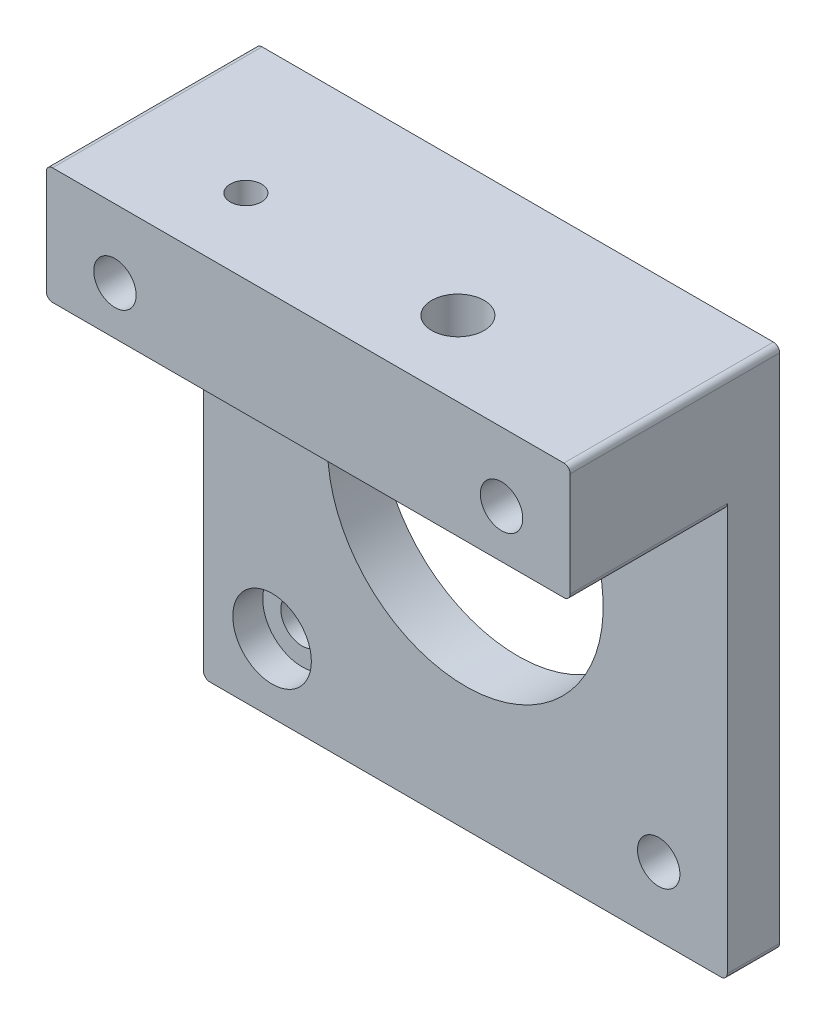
ISO-10303-21;
HEADER;
FILE_DESCRIPTION(('STEP AP214'),'2;1');
FILE_NAME('part.step','',(''),(''),'','','');
FILE_SCHEMA(('AUTOMOTIVE_DESIGN { 1 0 10303 214 1 1 1 1 }'));
ENDSEC;
DATA;
#1=APPLICATION_CONTEXT('core data for automotive mechanical design processes');
#2=APPLICATION_PROTOCOL_DEFINITION('international standard','automotive_design',2000,#1);
#3=PRODUCT_CONTEXT('',#1,'mechanical');
#4=PRODUCT('Part','Part','',(#3));
#5=PRODUCT_RELATED_PRODUCT_CATEGORY('part','',(#4));
#6=PRODUCT_DEFINITION_FORMATION('','',#4);
#7=PRODUCT_DEFINITION_CONTEXT('part definition',#1,'design');
#8=PRODUCT_DEFINITION('design','',#6,#7);
#9=PRODUCT_DEFINITION_SHAPE('','',#8);
#10=(LENGTH_UNIT() NAMED_UNIT(*) SI_UNIT(.MILLI.,.METRE.));
#11=(NAMED_UNIT(*) PLANE_ANGLE_UNIT() SI_UNIT($,.RADIAN.));
#12=(NAMED_UNIT(*) SI_UNIT($,.STERADIAN.) SOLID_ANGLE_UNIT());
#13=UNCERTAINTY_MEASURE_WITH_UNIT(LENGTH_MEASURE(1.E-05),#10,'distance_accuracy_value','');
#14=(GEOMETRIC_REPRESENTATION_CONTEXT(3) GLOBAL_UNCERTAINTY_ASSIGNED_CONTEXT((#13)) GLOBAL_UNIT_ASSIGNED_CONTEXT((#10,
#11,#12)) REPRESENTATION_CONTEXT('',''));
#15=CARTESIAN_POINT('',(0.,0.,0.));
#16=DIRECTION('',(0.,0.,1.));
#17=DIRECTION('',(1.,0.,0.));
#18=AXIS2_PLACEMENT_3D('',#15,#16,#17);
#19=CARTESIAN_POINT('',(-15.5,-15.5,1.8));
#20=DIRECTION('',(0.,0.,1.));
#21=DIRECTION('',(1.,0.,0.));
#22=AXIS2_PLACEMENT_3D('',#19,#20,#21);
#23=CYLINDRICAL_SURFACE('',#22,3.15);
#24=CARTESIAN_POINT('',(-15.5,-15.5,1.8));
#25=DIRECTION('',(0.,0.,1.));
#26=DIRECTION('',(1.,0.,0.));
#27=AXIS2_PLACEMENT_3D('',#24,#25,#26);
#28=CIRCLE('',#27,3.15);
#29=CARTESIAN_POINT('',(-12.35,-15.5,1.8));
#30=VERTEX_POINT('',#29);
#31=EDGE_CURVE('E20',#30,#30,#28,.T.);
#32=ORIENTED_EDGE('',*,*,#31,.F.);
#33=EDGE_LOOP('',(#32));
#34=FACE_BOUND('',#33,.T.);
#35=CARTESIAN_POINT('',(-15.5,-15.5,4.2));
#36=DIRECTION('',(0.,0.,1.));
#37=DIRECTION('',(1.,0.,0.));
#38=AXIS2_PLACEMENT_3D('',#35,#36,#37);
#39=CIRCLE('',#38,3.15);
#40=CARTESIAN_POINT('',(-12.35,-15.5,4.2));
#41=VERTEX_POINT('',#40);
#42=EDGE_CURVE('E218',#41,#41,#39,.T.);
#43=ORIENTED_EDGE('',*,*,#42,.T.);
#44=EDGE_LOOP('',(#43));
#45=FACE_BOUND('',#44,.T.);
#46=ADVANCED_FACE('F17',(#34,#45),#23,.F.);
#47=CARTESIAN_POINT('',(-21.,11.65,4.2));
#48=DIRECTION('',(0.,1.,0.));
#49=DIRECTION('',(0.,0.,1.));
#50=AXIS2_PLACEMENT_3D('',#47,#48,#49);
#51=PLANE('',#50);
#52=DIRECTION('',(0.,0.,1.));
#53=VECTOR('',#52,1.);
#54=CARTESIAN_POINT('',(20.5,11.65,4.2));
#55=LINE('',#54,#53);
#56=CARTESIAN_POINT('',(20.5,11.65,16.8));
#57=VERTEX_POINT('',#56);
#58=CARTESIAN_POINT('',(20.5,11.65,4.2));
#59=VERTEX_POINT('',#58);
#60=EDGE_CURVE('E171',#57,#59,#55,.F.);
#61=ORIENTED_EDGE('',*,*,#60,.F.);
#62=DIRECTION('',(1.,0.,0.));
#63=VECTOR('',#62,1.);
#64=CARTESIAN_POINT('',(0.,11.65,16.8));
#65=LINE('',#64,#63);
#66=CARTESIAN_POINT('',(-20.5,11.65,16.8));
#67=VERTEX_POINT('',#66);
#68=EDGE_CURVE('E158',#67,#57,#65,.T.);
#69=ORIENTED_EDGE('',*,*,#68,.F.);
#70=DIRECTION('',(0.,0.,1.));
#71=VECTOR('',#70,1.);
#72=CARTESIAN_POINT('',(-20.5,11.65,16.8));
#73=LINE('',#72,#71);
#74=CARTESIAN_POINT('',(-20.5,11.65,4.2));
#75=VERTEX_POINT('',#74);
#76=EDGE_CURVE('E174',#75,#67,#73,.T.);
#77=ORIENTED_EDGE('',*,*,#76,.F.);
#78=DIRECTION('',(-1.,0.,0.));
#79=VECTOR('',#78,1.);
#80=CARTESIAN_POINT('',(0.,11.65,4.2));
#81=LINE('',#80,#79);
#82=EDGE_CURVE('E143',#75,#59,#81,.F.);
#83=ORIENTED_EDGE('',*,*,#82,.T.);
#84=EDGE_LOOP('',(#61,#69,#77,#83));
#85=FACE_BOUND('',#84,.T.);
#86=CARTESIAN_POINT('',(6.,11.65,10.8));
#87=DIRECTION('',(0.,1.,0.));
#88=DIRECTION('',(0.,0.,1.));
#89=AXIS2_PLACEMENT_3D('',#86,#87,#88);
#90=CIRCLE('',#89,2.1);
#91=CARTESIAN_POINT('',(6.,11.65,12.9));
#92=VERTEX_POINT('',#91);
#93=EDGE_CURVE('E97',#92,#92,#90,.T.);
#94=ORIENTED_EDGE('',*,*,#93,.T.);
#95=EDGE_LOOP('',(#94));
#96=FACE_BOUND('',#95,.T.);
#97=CARTESIAN_POINT('',(-11.,11.65,10.8));
#98=DIRECTION('',(0.,1.,0.));
#99=DIRECTION('',(0.,0.,1.));
#100=AXIS2_PLACEMENT_3D('',#97,#98,#99);
#101=CIRCLE('',#100,1.25);
#102=CARTESIAN_POINT('',(-11.,11.65,12.05));
#103=VERTEX_POINT('',#102);
#104=EDGE_CURVE('E96',#103,#103,#101,.T.);
#105=ORIENTED_EDGE('',*,*,#104,.T.);
#106=EDGE_LOOP('',(#105));
#107=FACE_BOUND('',#106,.T.);
#108=ADVANCED_FACE('F234',(#85,#96,#107),#51,.F.);
#109=CARTESIAN_POINT('',(-15.5,-15.5,1.8));
#110=DIRECTION('',(0.,0.,1.));
#111=DIRECTION('',(1.,0.,0.));
#112=AXIS2_PLACEMENT_3D('',#109,#110,#111);
#113=PLANE('',#112);
#114=CARTESIAN_POINT('',(-15.5,-15.5,1.8));
#115=DIRECTION('',(0.,0.,1.));
#116=DIRECTION('',(1.,0.,0.));
#117=AXIS2_PLACEMENT_3D('',#114,#115,#116);
#118=CIRCLE('',#117,1.7);
#119=CARTESIAN_POINT('',(-13.8,-15.5,1.8));
#120=VERTEX_POINT('',#119);
#121=EDGE_CURVE('E199',#120,#120,#118,.F.);
#122=ORIENTED_EDGE('',*,*,#121,.T.);
#123=EDGE_LOOP('',(#122));
#124=FACE_BOUND('',#123,.T.);
#125=ORIENTED_EDGE('',*,*,#31,.T.);
#126=EDGE_LOOP('',(#125));
#127=FACE_BOUND('',#126,.T.);
#128=ADVANCED_FACE('F338',(#124,#127),#113,.T.);
#129=CARTESIAN_POINT('',(20.5,12.15,4.2));
#130=DIRECTION('',(0.,0.,1.));
#131=DIRECTION('',(1.,0.,0.));
#132=AXIS2_PLACEMENT_3D('',#129,#130,#131);
#133=CYLINDRICAL_SURFACE('',#132,0.5);
#134=CARTESIAN_POINT('',(20.5,12.15,16.8));
#135=DIRECTION('',(0.,0.,1.));
#136=DIRECTION('',(1.,0.,0.));
#137=AXIS2_PLACEMENT_3D('',#134,#135,#136);
#138=CIRCLE('',#137,0.5);
#139=CARTESIAN_POINT('',(21.,12.15,16.8));
#140=VERTEX_POINT('',#139);
#141=EDGE_CURVE('E160',#57,#140,#138,.T.);
#142=ORIENTED_EDGE('',*,*,#141,.F.);
#143=ORIENTED_EDGE('',*,*,#60,.T.);
#144=CARTESIAN_POINT('',(20.5,12.15,4.2));
#145=DIRECTION('',(0.,0.,1.));
#146=DIRECTION('',(1.,0.,0.));
#147=AXIS2_PLACEMENT_3D('',#144,#145,#146);
#148=CIRCLE('',#147,0.5);
#149=CARTESIAN_POINT('',(21.,12.15,4.2));
#150=VERTEX_POINT('',#149);
#151=EDGE_CURVE('E146',#59,#150,#148,.T.);
#152=ORIENTED_EDGE('',*,*,#151,.T.);
#153=DIRECTION('',(0.,0.,1.));
#154=VECTOR('',#153,1.);
#155=CARTESIAN_POINT('',(21.,12.15,16.8));
#156=LINE('',#155,#154);
#157=EDGE_CURVE('E165',#150,#140,#156,.T.);
#158=ORIENTED_EDGE('',*,*,#157,.T.);
#159=EDGE_LOOP('',(#142,#143,#152,#158));
#160=FACE_BOUND('',#159,.T.);
#161=ADVANCED_FACE('F240',(#160),#133,.T.);
#162=CARTESIAN_POINT('',(6.,21.,10.8));
#163=DIRECTION('',(0.,1.,0.));
#164=DIRECTION('',(0.,0.,1.));
#165=AXIS2_PLACEMENT_3D('',#162,#163,#164);
#166=CYLINDRICAL_SURFACE('',#165,2.1);
#167=ORIENTED_EDGE('',*,*,#93,.F.);
#168=EDGE_LOOP('',(#167));
#169=FACE_BOUND('',#168,.T.);
#170=CARTESIAN_POINT('',(6.,21.,10.8));
#171=DIRECTION('',(0.,1.,0.));
#172=DIRECTION('',(0.,0.,1.));
#173=AXIS2_PLACEMENT_3D('',#170,#171,#172);
#174=CIRCLE('',#173,2.1);
#175=CARTESIAN_POINT('',(6.,21.,12.9));
#176=VERTEX_POINT('',#175);
#177=EDGE_CURVE('E136',#176,#176,#174,.T.);
#178=ORIENTED_EDGE('',*,*,#177,.T.);
#179=EDGE_LOOP('',(#178));
#180=FACE_BOUND('',#179,.T.);
#181=ADVANCED_FACE('F237',(#169,#180),#166,.F.);
#182=CARTESIAN_POINT('',(20.5,20.5,16.8));
#183=DIRECTION('',(0.,0.,-1.));
#184=DIRECTION('',(-1.,0.,0.));
#185=AXIS2_PLACEMENT_3D('',#182,#183,#184);
#186=CYLINDRICAL_SURFACE('',#185,0.5);
#187=CARTESIAN_POINT('',(20.5,20.5,0.));
#188=DIRECTION('',(0.,0.,-1.));
#189=DIRECTION('',(-1.,0.,0.));
#190=AXIS2_PLACEMENT_3D('',#187,#188,#189);
#191=CIRCLE('',#190,0.5);
#192=CARTESIAN_POINT('',(21.,20.5,0.));
#193=VERTEX_POINT('',#192);
#194=CARTESIAN_POINT('',(20.5,21.,0.));
#195=VERTEX_POINT('',#194);
#196=EDGE_CURVE('E86',#193,#195,#191,.F.);
#197=ORIENTED_EDGE('',*,*,#196,.T.);
#198=DIRECTION('',(0.,0.,-1.));
#199=VECTOR('',#198,1.);
#200=CARTESIAN_POINT('',(20.5,21.,16.8));
#201=LINE('',#200,#199);
#202=CARTESIAN_POINT('',(20.5,21.,16.8));
#203=VERTEX_POINT('',#202);
#204=EDGE_CURVE('E92',#195,#203,#201,.F.);
#205=ORIENTED_EDGE('',*,*,#204,.T.);
#206=CARTESIAN_POINT('',(20.5,20.5,16.8));
#207=DIRECTION('',(0.,0.,-1.));
#208=DIRECTION('',(-1.,0.,0.));
#209=AXIS2_PLACEMENT_3D('',#206,#207,#208);
#210=CIRCLE('',#209,0.5);
#211=CARTESIAN_POINT('',(21.,20.5,16.8));
#212=VERTEX_POINT('',#211);
#213=EDGE_CURVE('E227',#212,#203,#210,.F.);
#214=ORIENTED_EDGE('',*,*,#213,.F.);
#215=DIRECTION('',(0.,0.,1.));
#216=VECTOR('',#215,1.);
#217=CARTESIAN_POINT('',(21.,20.5,16.8));
#218=LINE('',#217,#216);
#219=EDGE_CURVE('E94',#212,#193,#218,.F.);
#220=ORIENTED_EDGE('',*,*,#219,.T.);
#221=EDGE_LOOP('',(#197,#205,#214,#220));
#222=FACE_BOUND('',#221,.T.);
#223=ADVANCED_FACE('F91',(#222),#186,.T.);
#224=CARTESIAN_POINT('',(-11.,21.,10.8));
#225=DIRECTION('',(0.,1.,0.));
#226=DIRECTION('',(0.,0.,1.));
#227=AXIS2_PLACEMENT_3D('',#224,#225,#226);
#228=CYLINDRICAL_SURFACE('',#227,1.25);
#229=ORIENTED_EDGE('',*,*,#104,.F.);
#230=EDGE_LOOP('',(#229));
#231=FACE_BOUND('',#230,.T.);
#232=CARTESIAN_POINT('',(-11.,21.,10.8));
#233=DIRECTION('',(0.,1.,0.));
#234=DIRECTION('',(0.,0.,1.));
#235=AXIS2_PLACEMENT_3D('',#232,#233,#234);
#236=CIRCLE('',#235,1.25);
#237=CARTESIAN_POINT('',(-11.,21.,12.05));
#238=VERTEX_POINT('',#237);
#239=EDGE_CURVE('E132',#238,#238,#236,.T.);
#240=ORIENTED_EDGE('',*,*,#239,.T.);
#241=EDGE_LOOP('',(#240));
#242=FACE_BOUND('',#241,.T.);
#243=ADVANCED_FACE('F330',(#231,#242),#228,.F.);
#244=CARTESIAN_POINT('',(-20.5,20.5,16.8));
#245=DIRECTION('',(0.,0.,-1.));
#246=DIRECTION('',(-1.,0.,0.));
#247=AXIS2_PLACEMENT_3D('',#244,#245,#246);
#248=CYLINDRICAL_SURFACE('',#247,0.5);
#249=CARTESIAN_POINT('',(-20.5,20.5,0.));
#250=DIRECTION('',(0.,0.,-1.));
#251=DIRECTION('',(-1.,0.,0.));
#252=AXIS2_PLACEMENT_3D('',#249,#250,#251);
#253=CIRCLE('',#252,0.5);
#254=CARTESIAN_POINT('',(-20.5,21.,0.));
#255=VERTEX_POINT('',#254);
#256=CARTESIAN_POINT('',(-21.,20.5,0.));
#257=VERTEX_POINT('',#256);
#258=EDGE_CURVE('E112',#255,#257,#253,.F.);
#259=ORIENTED_EDGE('',*,*,#258,.T.);
#260=DIRECTION('',(0.,0.,-1.));
#261=VECTOR('',#260,1.);
#262=CARTESIAN_POINT('',(-21.,20.5,16.8));
#263=LINE('',#262,#261);
#264=CARTESIAN_POINT('',(-21.,20.5,16.8));
#265=VERTEX_POINT('',#264);
#266=EDGE_CURVE('E128',#257,#265,#263,.F.);
#267=ORIENTED_EDGE('',*,*,#266,.T.);
#268=CARTESIAN_POINT('',(-20.5,20.5,16.8));
#269=DIRECTION('',(0.,0.,-1.));
#270=DIRECTION('',(-1.,0.,0.));
#271=AXIS2_PLACEMENT_3D('',#268,#269,#270);
#272=CIRCLE('',#271,0.5);
#273=CARTESIAN_POINT('',(-20.5,21.,16.8));
#274=VERTEX_POINT('',#273);
#275=EDGE_CURVE('E161',#274,#265,#272,.F.);
#276=ORIENTED_EDGE('',*,*,#275,.F.);
#277=DIRECTION('',(0.,0.,-1.));
#278=VECTOR('',#277,1.);
#279=CARTESIAN_POINT('',(-20.5,21.,16.8));
#280=LINE('',#279,#278);
#281=EDGE_CURVE('E107',#274,#255,#280,.T.);
#282=ORIENTED_EDGE('',*,*,#281,.T.);
#283=EDGE_LOOP('',(#259,#267,#276,#282));
#284=FACE_BOUND('',#283,.T.);
#285=ADVANCED_FACE('F311',(#284),#248,.T.);
#286=CARTESIAN_POINT('',(0.,0.,16.8));
#287=DIRECTION('',(0.,0.,1.));
#288=DIRECTION('',(1.,0.,0.));
#289=AXIS2_PLACEMENT_3D('',#286,#287,#288);
#290=PLANE('',#289);
#291=ORIENTED_EDGE('',*,*,#68,.T.);
#292=ORIENTED_EDGE('',*,*,#141,.T.);
#293=DIRECTION('',(0.,-1.,0.));
#294=VECTOR('',#293,1.);
#295=CARTESIAN_POINT('',(21.,21.,16.8));
#296=LINE('',#295,#294);
#297=EDGE_CURVE('E142',#140,#212,#296,.F.);
#298=ORIENTED_EDGE('',*,*,#297,.T.);
#299=ORIENTED_EDGE('',*,*,#213,.T.);
#300=DIRECTION('',(1.,0.,0.));
#301=VECTOR('',#300,1.);
#302=CARTESIAN_POINT('',(-21.,21.,16.8));
#303=LINE('',#302,#301);
#304=EDGE_CURVE('E106',#203,#274,#303,.F.);
#305=ORIENTED_EDGE('',*,*,#304,.T.);
#306=ORIENTED_EDGE('',*,*,#275,.T.);
#307=DIRECTION('',(0.,1.,0.));
#308=VECTOR('',#307,1.);
#309=CARTESIAN_POINT('',(-21.,21.,16.8));
#310=LINE('',#309,#308);
#311=CARTESIAN_POINT('',(-21.,12.15,16.8));
#312=VERTEX_POINT('',#311);
#313=EDGE_CURVE('E131',#265,#312,#310,.F.);
#314=ORIENTED_EDGE('',*,*,#313,.T.);
#315=CARTESIAN_POINT('',(-20.5,12.15,16.8));
#316=DIRECTION('',(0.,0.,1.));
#317=DIRECTION('',(1.,0.,0.));
#318=AXIS2_PLACEMENT_3D('',#315,#316,#317);
#319=CIRCLE('',#318,0.5);
#320=EDGE_CURVE('E176',#67,#312,#319,.F.);
#321=ORIENTED_EDGE('',*,*,#320,.F.);
#322=EDGE_LOOP('',(#291,#292,#298,#299,#305,#306,#314,#321));
#323=FACE_BOUND('',#322,.T.);
#324=CARTESIAN_POINT('',(-15.5,15.5,16.8));
#325=DIRECTION('',(0.,0.,1.));
#326=DIRECTION('',(1.,0.,0.));
#327=AXIS2_PLACEMENT_3D('',#324,#325,#326);
#328=CIRCLE('',#327,1.7);
#329=CARTESIAN_POINT('',(-13.8,15.5,16.8));
#330=VERTEX_POINT('',#329);
#331=EDGE_CURVE('E202',#330,#330,#328,.F.);
#332=ORIENTED_EDGE('',*,*,#331,.T.);
#333=EDGE_LOOP('',(#332));
#334=FACE_BOUND('',#333,.T.);
#335=CARTESIAN_POINT('',(15.5,15.5,16.8));
#336=DIRECTION('',(0.,0.,1.));
#337=DIRECTION('',(1.,0.,0.));
#338=AXIS2_PLACEMENT_3D('',#335,#336,#337);
#339=CIRCLE('',#338,1.7);
#340=CARTESIAN_POINT('',(17.2,15.5,16.8));
#341=VERTEX_POINT('',#340);
#342=EDGE_CURVE('E205',#341,#341,#339,.F.);
#343=ORIENTED_EDGE('',*,*,#342,.T.);
#344=EDGE_LOOP('',(#343));
#345=FACE_BOUND('',#344,.T.);
#346=ADVANCED_FACE('F307',(#323,#334,#345),#290,.T.);
#347=CARTESIAN_POINT('',(-20.5,12.15,16.8));
#348=DIRECTION('',(0.,0.,1.));
#349=DIRECTION('',(1.,0.,0.));
#350=AXIS2_PLACEMENT_3D('',#347,#348,#349);
#351=CYLINDRICAL_SURFACE('',#350,0.5);
#352=ORIENTED_EDGE('',*,*,#320,.T.);
#353=DIRECTION('',(0.,0.,-1.));
#354=VECTOR('',#353,1.);
#355=CARTESIAN_POINT('',(-21.,12.15,16.8));
#356=LINE('',#355,#354);
#357=CARTESIAN_POINT('',(-21.,12.15,4.2));
#358=VERTEX_POINT('',#357);
#359=EDGE_CURVE('E153',#312,#358,#356,.T.);
#360=ORIENTED_EDGE('',*,*,#359,.T.);
#361=CARTESIAN_POINT('',(-20.5,12.15,4.2));
#362=DIRECTION('',(0.,0.,1.));
#363=DIRECTION('',(1.,0.,0.));
#364=AXIS2_PLACEMENT_3D('',#361,#362,#363);
#365=CIRCLE('',#364,0.5);
#366=EDGE_CURVE('E147',#358,#75,#365,.T.);
#367=ORIENTED_EDGE('',*,*,#366,.T.);
#368=ORIENTED_EDGE('',*,*,#76,.T.);
#369=EDGE_LOOP('',(#352,#360,#367,#368));
#370=FACE_BOUND('',#369,.T.);
#371=ADVANCED_FACE('F301',(#370),#351,.T.);
#372=CARTESIAN_POINT('',(20.5,-20.5,16.8));
#373=DIRECTION('',(0.,0.,-1.));
#374=DIRECTION('',(-1.,0.,0.));
#375=AXIS2_PLACEMENT_3D('',#372,#373,#374);
#376=CYLINDRICAL_SURFACE('',#375,0.5);
#377=CARTESIAN_POINT('',(20.5,-20.5,0.));
#378=DIRECTION('',(0.,0.,-1.));
#379=DIRECTION('',(-1.,0.,0.));
#380=AXIS2_PLACEMENT_3D('',#377,#378,#379);
#381=CIRCLE('',#380,0.5);
#382=CARTESIAN_POINT('',(20.5,-21.,0.));
#383=VERTEX_POINT('',#382);
#384=CARTESIAN_POINT('',(21.,-20.5,0.));
#385=VERTEX_POINT('',#384);
#386=EDGE_CURVE('E222',#383,#385,#381,.F.);
#387=ORIENTED_EDGE('',*,*,#386,.T.);
#388=DIRECTION('',(0.,0.,1.));
#389=VECTOR('',#388,1.);
#390=CARTESIAN_POINT('',(21.,-20.5,16.8));
#391=LINE('',#390,#389);
#392=CARTESIAN_POINT('',(21.,-20.5,4.2));
#393=VERTEX_POINT('',#392);
#394=EDGE_CURVE('E137',#385,#393,#391,.T.);
#395=ORIENTED_EDGE('',*,*,#394,.T.);
#396=CARTESIAN_POINT('',(20.5,-20.5,4.2));
#397=DIRECTION('',(0.,0.,-1.));
#398=DIRECTION('',(-1.,0.,0.));
#399=AXIS2_PLACEMENT_3D('',#396,#397,#398);
#400=CIRCLE('',#399,0.5);
#401=CARTESIAN_POINT('',(20.5,-21.,4.2));
#402=VERTEX_POINT('',#401);
#403=EDGE_CURVE('E211',#393,#402,#400,.T.);
#404=ORIENTED_EDGE('',*,*,#403,.T.);
#405=DIRECTION('',(0.,0.,1.));
#406=VECTOR('',#405,1.);
#407=CARTESIAN_POINT('',(20.5,-21.,16.8));
#408=LINE('',#407,#406);
#409=EDGE_CURVE('E124',#402,#383,#408,.F.);
#410=ORIENTED_EDGE('',*,*,#409,.T.);
#411=EDGE_LOOP('',(#387,#395,#404,#410));
#412=FACE_BOUND('',#411,.T.);
#413=ADVANCED_FACE('F274',(#412),#376,.T.);
#414=CARTESIAN_POINT('',(-20.5,-20.5,16.8));
#415=DIRECTION('',(0.,0.,-1.));
#416=DIRECTION('',(-1.,0.,0.));
#417=AXIS2_PLACEMENT_3D('',#414,#415,#416);
#418=CYLINDRICAL_SURFACE('',#417,0.5);
#419=CARTESIAN_POINT('',(-20.5,-20.5,0.));
#420=DIRECTION('',(0.,0.,-1.));
#421=DIRECTION('',(-1.,0.,0.));
#422=AXIS2_PLACEMENT_3D('',#419,#420,#421);
#423=CIRCLE('',#422,0.5);
#424=CARTESIAN_POINT('',(-21.,-20.5,0.));
#425=VERTEX_POINT('',#424);
#426=CARTESIAN_POINT('',(-20.5,-21.,0.));
#427=VERTEX_POINT('',#426);
#428=EDGE_CURVE('E35',#425,#427,#423,.F.);
#429=ORIENTED_EDGE('',*,*,#428,.T.);
#430=DIRECTION('',(0.,0.,1.));
#431=VECTOR('',#430,1.);
#432=CARTESIAN_POINT('',(-20.5,-21.,16.8));
#433=LINE('',#432,#431);
#434=CARTESIAN_POINT('',(-20.5,-21.,4.2));
#435=VERTEX_POINT('',#434);
#436=EDGE_CURVE('E121',#427,#435,#433,.T.);
#437=ORIENTED_EDGE('',*,*,#436,.T.);
#438=CARTESIAN_POINT('',(-20.5,-20.5,4.2));
#439=DIRECTION('',(0.,0.,-1.));
#440=DIRECTION('',(-1.,0.,0.));
#441=AXIS2_PLACEMENT_3D('',#438,#439,#440);
#442=CIRCLE('',#441,0.5);
#443=CARTESIAN_POINT('',(-21.,-20.5,4.2));
#444=VERTEX_POINT('',#443);
#445=EDGE_CURVE('E208',#435,#444,#442,.T.);
#446=ORIENTED_EDGE('',*,*,#445,.T.);
#447=DIRECTION('',(0.,0.,-1.));
#448=VECTOR('',#447,1.);
#449=CARTESIAN_POINT('',(-21.,-20.5,16.8));
#450=LINE('',#449,#448);
#451=EDGE_CURVE('E127',#444,#425,#450,.T.);
#452=ORIENTED_EDGE('',*,*,#451,.T.);
#453=EDGE_LOOP('',(#429,#437,#446,#452));
#454=FACE_BOUND('',#453,.T.);
#455=ADVANCED_FACE('F312',(#454),#418,.T.);
#456=CARTESIAN_POINT('',(0.,0.,4.2));
#457=DIRECTION('',(0.,0.,-1.));
#458=DIRECTION('',(-1.,0.,0.));
#459=AXIS2_PLACEMENT_3D('',#456,#457,#458);
#460=PLANE('',#459);
#461=ORIENTED_EDGE('',*,*,#445,.F.);
#462=DIRECTION('',(1.,0.,0.));
#463=VECTOR('',#462,1.);
#464=CARTESIAN_POINT('',(-21.,-21.,4.2));
#465=LINE('',#464,#463);
#466=EDGE_CURVE('E123',#435,#402,#465,.T.);
#467=ORIENTED_EDGE('',*,*,#466,.T.);
#468=ORIENTED_EDGE('',*,*,#403,.F.);
#469=DIRECTION('',(0.,-1.,0.));
#470=VECTOR('',#469,1.);
#471=CARTESIAN_POINT('',(21.,21.,4.2));
#472=LINE('',#471,#470);
#473=EDGE_CURVE('E140',#393,#150,#472,.F.);
#474=ORIENTED_EDGE('',*,*,#473,.T.);
#475=ORIENTED_EDGE('',*,*,#151,.F.);
#476=ORIENTED_EDGE('',*,*,#82,.F.);
#477=ORIENTED_EDGE('',*,*,#366,.F.);
#478=DIRECTION('',(0.,1.,0.));
#479=VECTOR('',#478,1.);
#480=CARTESIAN_POINT('',(-21.,21.,4.2));
#481=LINE('',#480,#479);
#482=EDGE_CURVE('E133',#358,#444,#481,.F.);
#483=ORIENTED_EDGE('',*,*,#482,.T.);
#484=EDGE_LOOP('',(#461,#467,#468,#474,#475,#476,#477,#483));
#485=FACE_BOUND('',#484,.T.);
#486=CARTESIAN_POINT('',(0.,0.,4.2));
#487=DIRECTION('',(0.,0.,-1.));
#488=DIRECTION('',(-1.,0.,0.));
#489=AXIS2_PLACEMENT_3D('',#486,#487,#488);
#490=CIRCLE('',#489,11.05);
#491=CARTESIAN_POINT('',(-11.05,0.,4.2));
#492=VERTEX_POINT('',#491);
#493=EDGE_CURVE('E168',#492,#492,#490,.T.);
#494=ORIENTED_EDGE('',*,*,#493,.T.);
#495=EDGE_LOOP('',(#494));
#496=FACE_BOUND('',#495,.T.);
#497=CARTESIAN_POINT('',(15.5,-15.5,4.2));
#498=DIRECTION('',(0.,0.,1.));
#499=DIRECTION('',(1.,0.,0.));
#500=AXIS2_PLACEMENT_3D('',#497,#498,#499);
#501=CIRCLE('',#500,1.7);
#502=CARTESIAN_POINT('',(17.2,-15.5,4.2));
#503=VERTEX_POINT('',#502);
#504=EDGE_CURVE('E196',#503,#503,#501,.F.);
#505=ORIENTED_EDGE('',*,*,#504,.T.);
#506=EDGE_LOOP('',(#505));
#507=FACE_BOUND('',#506,.T.);
#508=ORIENTED_EDGE('',*,*,#42,.F.);
#509=EDGE_LOOP('',(#508));
#510=FACE_BOUND('',#509,.T.);
#511=ADVANCED_FACE('F298',(#485,#496,#507,#510),#460,.F.);
#512=CARTESIAN_POINT('',(15.5,15.5,16.8));
#513=DIRECTION('',(0.,0.,1.));
#514=DIRECTION('',(1.,0.,0.));
#515=AXIS2_PLACEMENT_3D('',#512,#513,#514);
#516=CYLINDRICAL_SURFACE('',#515,1.7);
#517=CARTESIAN_POINT('',(15.5,15.5,0.));
#518=DIRECTION('',(0.,0.,1.));
#519=DIRECTION('',(1.,0.,0.));
#520=AXIS2_PLACEMENT_3D('',#517,#518,#519);
#521=CIRCLE('',#520,1.7);
#522=CARTESIAN_POINT('',(17.2,15.5,0.));
#523=VERTEX_POINT('',#522);
#524=EDGE_CURVE('E150',#523,#523,#521,.F.);
#525=ORIENTED_EDGE('',*,*,#524,.T.);
#526=EDGE_LOOP('',(#525));
#527=FACE_BOUND('',#526,.T.);
#528=ORIENTED_EDGE('',*,*,#342,.F.);
#529=EDGE_LOOP('',(#528));
#530=FACE_BOUND('',#529,.T.);
#531=ADVANCED_FACE('F319',(#527,#530),#516,.F.);
#532=CARTESIAN_POINT('',(-15.5,15.5,16.8));
#533=DIRECTION('',(0.,0.,1.));
#534=DIRECTION('',(1.,0.,0.));
#535=AXIS2_PLACEMENT_3D('',#532,#533,#534);
#536=CYLINDRICAL_SURFACE('',#535,1.7);
#537=CARTESIAN_POINT('',(-15.5,15.5,0.));
#538=DIRECTION('',(0.,0.,1.));
#539=DIRECTION('',(1.,0.,0.));
#540=AXIS2_PLACEMENT_3D('',#537,#538,#539);
#541=CIRCLE('',#540,1.7);
#542=CARTESIAN_POINT('',(-13.8,15.5,0.));
#543=VERTEX_POINT('',#542);
#544=EDGE_CURVE('E185',#543,#543,#541,.F.);
#545=ORIENTED_EDGE('',*,*,#544,.T.);
#546=EDGE_LOOP('',(#545));
#547=FACE_BOUND('',#546,.T.);
#548=ORIENTED_EDGE('',*,*,#331,.F.);
#549=EDGE_LOOP('',(#548));
#550=FACE_BOUND('',#549,.T.);
#551=ADVANCED_FACE('F437',(#547,#550),#536,.F.);
#552=CARTESIAN_POINT('',(-15.5,-15.5,16.8));
#553=DIRECTION('',(0.,0.,1.));
#554=DIRECTION('',(1.,0.,0.));
#555=AXIS2_PLACEMENT_3D('',#552,#553,#554);
#556=CYLINDRICAL_SURFACE('',#555,1.7);
#557=CARTESIAN_POINT('',(-15.5,-15.5,0.));
#558=DIRECTION('',(0.,0.,1.));
#559=DIRECTION('',(1.,0.,0.));
#560=AXIS2_PLACEMENT_3D('',#557,#558,#559);
#561=CIRCLE('',#560,1.7);
#562=CARTESIAN_POINT('',(-13.8,-15.5,0.));
#563=VERTEX_POINT('',#562);
#564=EDGE_CURVE('E182',#563,#563,#561,.F.);
#565=ORIENTED_EDGE('',*,*,#564,.T.);
#566=EDGE_LOOP('',(#565));
#567=FACE_BOUND('',#566,.T.);
#568=ORIENTED_EDGE('',*,*,#121,.F.);
#569=EDGE_LOOP('',(#568));
#570=FACE_BOUND('',#569,.T.);
#571=ADVANCED_FACE('F446',(#567,#570),#556,.F.);
#572=CARTESIAN_POINT('',(15.5,-15.5,16.8));
#573=DIRECTION('',(0.,0.,1.));
#574=DIRECTION('',(1.,0.,0.));
#575=AXIS2_PLACEMENT_3D('',#572,#573,#574);
#576=CYLINDRICAL_SURFACE('',#575,1.7);
#577=CARTESIAN_POINT('',(15.5,-15.5,0.));
#578=DIRECTION('',(0.,0.,1.));
#579=DIRECTION('',(1.,0.,0.));
#580=AXIS2_PLACEMENT_3D('',#577,#578,#579);
#581=CIRCLE('',#580,1.7);
#582=CARTESIAN_POINT('',(17.2,-15.5,0.));
#583=VERTEX_POINT('',#582);
#584=EDGE_CURVE('E179',#583,#583,#581,.F.);
#585=ORIENTED_EDGE('',*,*,#584,.T.);
#586=EDGE_LOOP('',(#585));
#587=FACE_BOUND('',#586,.T.);
#588=ORIENTED_EDGE('',*,*,#504,.F.);
#589=EDGE_LOOP('',(#588));
#590=FACE_BOUND('',#589,.T.);
#591=ADVANCED_FACE('F456',(#587,#590),#576,.F.);
#592=CARTESIAN_POINT('',(0.,0.,16.801));
#593=DIRECTION('',(0.,0.,-1.));
#594=DIRECTION('',(-1.,0.,0.));
#595=AXIS2_PLACEMENT_3D('',#592,#593,#594);
#596=CYLINDRICAL_SURFACE('',#595,11.05);
#597=ORIENTED_EDGE('',*,*,#493,.F.);
#598=EDGE_LOOP('',(#597));
#599=FACE_BOUND('',#598,.T.);
#600=CARTESIAN_POINT('',(0.,0.,0.));
#601=DIRECTION('',(0.,0.,-1.));
#602=DIRECTION('',(-1.,0.,0.));
#603=AXIS2_PLACEMENT_3D('',#600,#601,#602);
#604=CIRCLE('',#603,11.05);
#605=CARTESIAN_POINT('',(-11.05,0.,0.));
#606=VERTEX_POINT('',#605);
#607=EDGE_CURVE('E118',#606,#606,#604,.T.);
#608=ORIENTED_EDGE('',*,*,#607,.T.);
#609=EDGE_LOOP('',(#608));
#610=FACE_BOUND('',#609,.T.);
#611=ADVANCED_FACE('F256',(#599,#610),#596,.F.);
#612=CARTESIAN_POINT('',(21.,21.,16.8));
#613=DIRECTION('',(-1.,0.,0.));
#614=DIRECTION('',(0.,-1.,0.));
#615=AXIS2_PLACEMENT_3D('',#612,#613,#614);
#616=PLANE('',#615);
#617=ORIENTED_EDGE('',*,*,#394,.F.);
#618=DIRECTION('',(0.,1.,0.));
#619=VECTOR('',#618,1.);
#620=CARTESIAN_POINT('',(21.,0.,0.));
#621=LINE('',#620,#619);
#622=EDGE_CURVE('E114',#385,#193,#621,.T.);
#623=ORIENTED_EDGE('',*,*,#622,.T.);
#624=ORIENTED_EDGE('',*,*,#219,.F.);
#625=ORIENTED_EDGE('',*,*,#297,.F.);
#626=ORIENTED_EDGE('',*,*,#157,.F.);
#627=ORIENTED_EDGE('',*,*,#473,.F.);
#628=EDGE_LOOP('',(#617,#623,#624,#625,#626,#627));
#629=FACE_BOUND('',#628,.T.);
#630=ADVANCED_FACE('F245',(#629),#616,.F.);
#631=CARTESIAN_POINT('',(-21.,21.,16.8));
#632=DIRECTION('',(0.,-1.,0.));
#633=DIRECTION('',(0.,0.,-1.));
#634=AXIS2_PLACEMENT_3D('',#631,#632,#633);
#635=PLANE('',#634);
#636=ORIENTED_EDGE('',*,*,#239,.F.);
#637=EDGE_LOOP('',(#636));
#638=FACE_BOUND('',#637,.T.);
#639=ORIENTED_EDGE('',*,*,#204,.F.);
#640=DIRECTION('',(1.,0.,0.));
#641=VECTOR('',#640,1.);
#642=CARTESIAN_POINT('',(0.,21.,0.));
#643=LINE('',#642,#641);
#644=EDGE_CURVE('E104',#195,#255,#643,.F.);
#645=ORIENTED_EDGE('',*,*,#644,.T.);
#646=ORIENTED_EDGE('',*,*,#281,.F.);
#647=ORIENTED_EDGE('',*,*,#304,.F.);
#648=EDGE_LOOP('',(#639,#645,#646,#647));
#649=FACE_BOUND('',#648,.T.);
#650=ORIENTED_EDGE('',*,*,#177,.F.);
#651=EDGE_LOOP('',(#650));
#652=FACE_BOUND('',#651,.T.);
#653=ADVANCED_FACE('F102',(#638,#649,#652),#635,.F.);
#654=CARTESIAN_POINT('',(-21.,21.,16.8));
#655=DIRECTION('',(1.,0.,0.));
#656=DIRECTION('',(0.,0.,-1.));
#657=AXIS2_PLACEMENT_3D('',#654,#655,#656);
#658=PLANE('',#657);
#659=ORIENTED_EDGE('',*,*,#451,.F.);
#660=ORIENTED_EDGE('',*,*,#482,.F.);
#661=ORIENTED_EDGE('',*,*,#359,.F.);
#662=ORIENTED_EDGE('',*,*,#313,.F.);
#663=ORIENTED_EDGE('',*,*,#266,.F.);
#664=DIRECTION('',(0.,1.,0.));
#665=VECTOR('',#664,1.);
#666=CARTESIAN_POINT('',(-21.,0.,0.));
#667=LINE('',#666,#665);
#668=EDGE_CURVE('E26',#257,#425,#667,.F.);
#669=ORIENTED_EDGE('',*,*,#668,.T.);
#670=EDGE_LOOP('',(#659,#660,#661,#662,#663,#669));
#671=FACE_BOUND('',#670,.T.);
#672=ADVANCED_FACE('F244',(#671),#658,.F.);
#673=CARTESIAN_POINT('',(-21.,-21.,16.8));
#674=DIRECTION('',(0.,1.,0.));
#675=DIRECTION('',(0.,0.,1.));
#676=AXIS2_PLACEMENT_3D('',#673,#674,#675);
#677=PLANE('',#676);
#678=ORIENTED_EDGE('',*,*,#436,.F.);
#679=DIRECTION('',(1.,0.,0.));
#680=VECTOR('',#679,1.);
#681=CARTESIAN_POINT('',(0.,-21.,0.));
#682=LINE('',#681,#680);
#683=EDGE_CURVE('E11',#427,#383,#682,.T.);
#684=ORIENTED_EDGE('',*,*,#683,.T.);
#685=ORIENTED_EDGE('',*,*,#409,.F.);
#686=ORIENTED_EDGE('',*,*,#466,.F.);
#687=EDGE_LOOP('',(#678,#684,#685,#686));
#688=FACE_BOUND('',#687,.T.);
#689=ADVANCED_FACE('F253',(#688),#677,.F.);
#690=CARTESIAN_POINT('',(0.,0.,0.));
#691=DIRECTION('',(0.,0.,1.));
#692=DIRECTION('',(1.,0.,0.));
#693=AXIS2_PLACEMENT_3D('',#690,#691,#692);
#694=PLANE('',#693);
#695=ORIENTED_EDGE('',*,*,#428,.F.);
#696=ORIENTED_EDGE('',*,*,#668,.F.);
#697=ORIENTED_EDGE('',*,*,#258,.F.);
#698=ORIENTED_EDGE('',*,*,#644,.F.);
#699=ORIENTED_EDGE('',*,*,#196,.F.);
#700=ORIENTED_EDGE('',*,*,#622,.F.);
#701=ORIENTED_EDGE('',*,*,#386,.F.);
#702=ORIENTED_EDGE('',*,*,#683,.F.);
#703=EDGE_LOOP('',(#695,#696,#697,#698,#699,#700,#701,#702));
#704=FACE_BOUND('',#703,.T.);
#705=ORIENTED_EDGE('',*,*,#607,.F.);
#706=EDGE_LOOP('',(#705));
#707=FACE_BOUND('',#706,.T.);
#708=ORIENTED_EDGE('',*,*,#584,.F.);
#709=EDGE_LOOP('',(#708));
#710=FACE_BOUND('',#709,.T.);
#711=ORIENTED_EDGE('',*,*,#564,.F.);
#712=EDGE_LOOP('',(#711));
#713=FACE_BOUND('',#712,.T.);
#714=ORIENTED_EDGE('',*,*,#544,.F.);
#715=EDGE_LOOP('',(#714));
#716=FACE_BOUND('',#715,.T.);
#717=ORIENTED_EDGE('',*,*,#524,.F.);
#718=EDGE_LOOP('',(#717));
#719=FACE_BOUND('',#718,.T.);
#720=ADVANCED_FACE('F109',(#704,#707,#710,#713,#716,#719),#694,.F.);
#721=CLOSED_SHELL('',(#46,#108,#128,#161,#181,#223,#243,#285,#346,#371,#413,#455,#511,#531,#551,
#571,#591,#611,#630,#653,#672,#689,#720));
#722=MANIFOLD_SOLID_BREP('B1',#721);
#723=ADVANCED_BREP_SHAPE_REPRESENTATION('',(#18,#722),#14);
#724=SHAPE_DEFINITION_REPRESENTATION(#9,#723);
ENDSEC;
END-ISO-10303-21;
